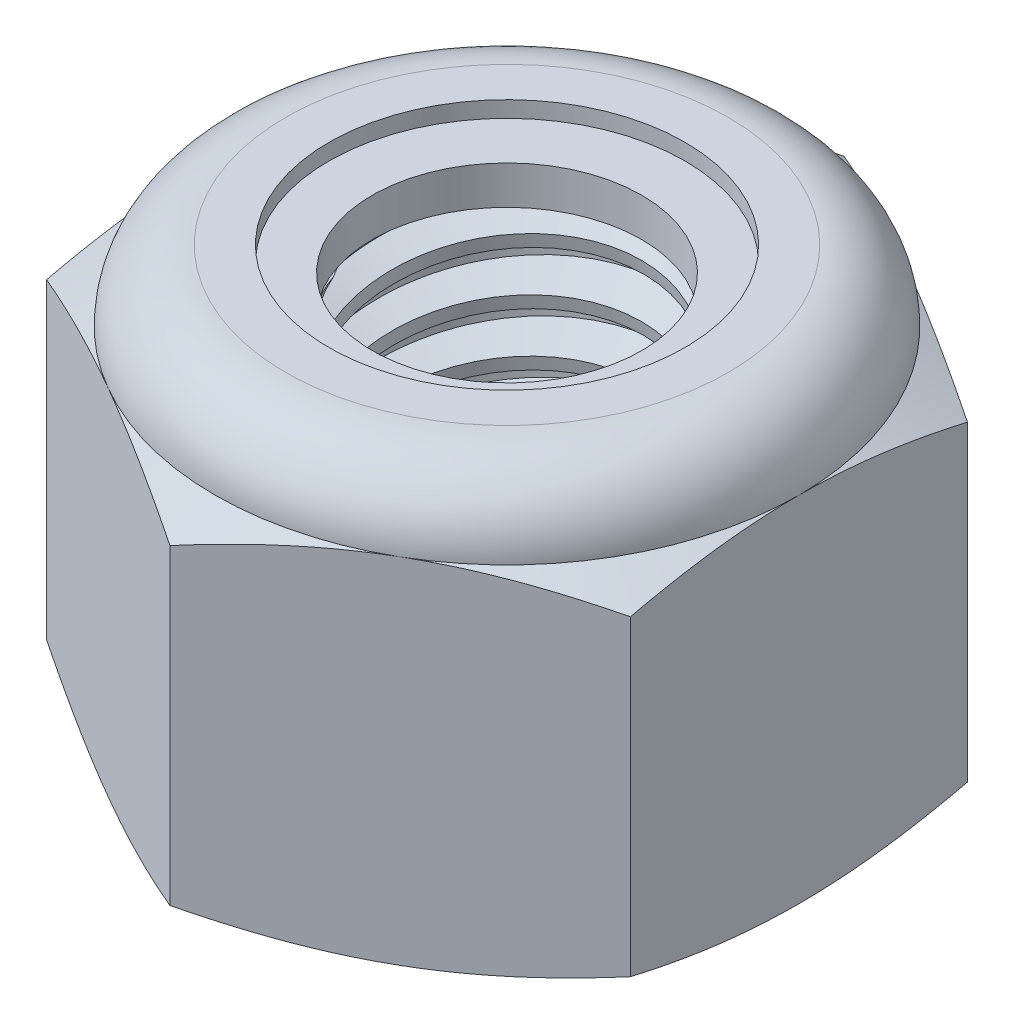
from build123d import *

# Parameters (mm, degrees)
EXTRUDE1_DEPTH      = 4
SKETCH2_W           = 1.5
SKETCH2_H           = 4
LPATTERN1_COUNT     = 8
LPATTERN1_PITCH     = 0.5
LPATTERN1_COL_COUNT = 2
LPATTERN1_COL_PITCH = 0.5


with BuildPart() as part:
    # Sketch1 → Extrude1 (new body)
    with BuildSketch(Plane(origin=(0, 0, 0), x_dir=(1, 0, 0), z_dir=(0, 1, 0))):
        Polygon((0, 3.175426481), (-2.75, 1.58771324), (-2.75, -1.58771324), (0, -3.175426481), (2.75, -1.58771324), (2.75, 1.58771324), align=None)
    extrude(amount=EXTRUDE1_DEPTH)

    # Sketch4 → Cut-Revolve2 (revolve, cut)
    with BuildSketch(Plane(origin=(0, 0, 0), x_dir=(0, 0, -1), z_dir=(1, 0, 0)), mode=Mode.PRIVATE) as cut_revolve2_sk:
        Polygon((0, 4), (1.5, 4), (1.269011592, 3.892288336), (1.269011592, 0.107711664), (1.5, 0), (0, 0), align=None)
    revolve(cut_revolve2_sk.sketch.rotate(Axis((0, 4, 0), (0, 1, 0)), 55.157981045), axis=Axis((0, 4, 0), (0, 1, 0)), mode=Mode.SUBTRACT)


with BuildPart() as body_2:
    # Sketch2 → Revolve1 (revolve)
    with BuildSketch(Plane(origin=(0, 0, 0), x_dir=(0, 0, -1), z_dir=(1, 0, 0))):
        with Locations((0.75, 2)):
            Rectangle(SKETCH2_W, SKETCH2_H)
    revolve(axis=Axis((0, -1.5, 0), (0, 1, 0)))

    # Sketch3 → Cut-Revolve1 (revolve, cut)
    with BuildSketch(Plane(origin=(0, 0, 0), x_dir=(0, 0, -1), z_dir=(1, 0, 0)), mode=Mode.PRIVATE) as cut_revolve1_sk:
        Polygon((1.510274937, 3.93835038), (1.582199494, 3.506803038), (1.289561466, 3.616435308), (1.269011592, 3.739734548), align=None)
    cut_revolve1 = revolve(cut_revolve1_sk.sketch.rotate(Axis((0, 4, 0.089188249), (0, -0.9863939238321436, -0.16439898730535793)), 180), axis=Axis((0, 4, 0.089188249), (0, -0.9863939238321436, -0.16439898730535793)), mode=Mode.SUBTRACT)

    # LPattern1: Cut-Revolve1 ×8
    with Locations(*[(0, -i * LPATTERN1_PITCH, 0) for i in range(1, LPATTERN1_COUNT)]):
        add(cut_revolve1, mode=Mode.SUBTRACT)

    # LPattern1 col: Cut-Revolve1 ×2
    with Locations(*[(0, i * LPATTERN1_COL_PITCH, 0) for i in range(1, LPATTERN1_COL_COUNT)]):
        add(cut_revolve1, mode=Mode.SUBTRACT)


with BuildPart() as part_1:
    add(part.part)

    # Combine1: cut body 2
    add(body_2.part, mode=Mode.SUBTRACT)

    # Sketch5 → Cut-Revolve3 (revolve, cut)
    with BuildSketch(Plane(origin=(0, 0, 0), x_dir=(0, 0, -1), z_dir=(1, 0, 0)), mode=Mode.PRIVATE) as cut_revolve3_sk:
        with BuildLine():
            Line((0, 0), (2.75, 0))
            Line((2.75, 0), (3.175426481, 0.198379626))
            Line((3.175426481, 0.198379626), (3.175426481, 3.134953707))
            Line((3.175426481, 3.134953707), (2.75, 3.333333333))
            ThreePointArc((2.75, 3.333333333), (2.554737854, 3.804737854), (2.083333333, 4))
            Line((2.083333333, 4), (2.083333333, 5.27))
            Line((2.083333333, 5.27), (4.445426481, 5.27))
            Line((4.445426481, 5.27), (4.445426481, -1.27))
            Line((4.445426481, -1.27), (0, -1.27))
            Line((0, -1.27), (0, 0))
        make_face()
    revolve(cut_revolve3_sk.sketch.rotate(Axis((0, 0, 0), (0, 1, 0)), 55.157981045), axis=Axis((0, 0, 0), (0, 1, 0)), mode=Mode.SUBTRACT)

    # Sketch6 → Cut-Revolve4 (revolve, cut)
    with BuildSketch(Plane(origin=(0, 0, 0), x_dir=(0, 0, -1), z_dir=(1, 0, 0)), mode=Mode.PRIVATE) as cut_revolve4_sk:
        with BuildLine():
            Line((0, 3.333333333), (2.5976, 3.333333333))
            ThreePointArc((2.5976, 3.333333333), (2.446974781, 3.696974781), (2.083333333, 3.8476))
            Line((2.083333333, 3.8476), (1.676172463, 3.8476))
            Line((1.676172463, 3.8476), (1.676172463, 5.27))
            Line((1.676172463, 5.27), (0, 5.27))
            Line((0, 5.27), (0, 3.333333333))
        make_face()
    revolve(cut_revolve4_sk.sketch.rotate(Axis((0, 5.27, 0), (0, 1, 0)), 55.157981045), axis=Axis((0, 5.27, 0), (0, 1, 0)), mode=Mode.SUBTRACT)


with BuildPart() as body_2_2:
    # Sketch7 → Revolve2 (revolve)
    with BuildSketch(Plane(origin=(0, 0, 0), x_dir=(0, 0, -1), z_dir=(1, 0, 0))):
        with BuildLine():
            Line((1.269011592, 3.409533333), (2.514721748, 3.409533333))
            ThreePointArc((2.514721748, 3.409533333), (2.36486639, 3.668954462), (2.083333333, 3.7714))
            Line((2.083333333, 3.7714), (1.269011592, 3.7714))
            Line((1.269011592, 3.7714), (1.269011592, 3.409533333))
        make_face()
    revolve(axis=Axis((0, 3.409533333, 0), (0, 1, 0)))


solid = Compound([part_1.part, body_2_2.part])
